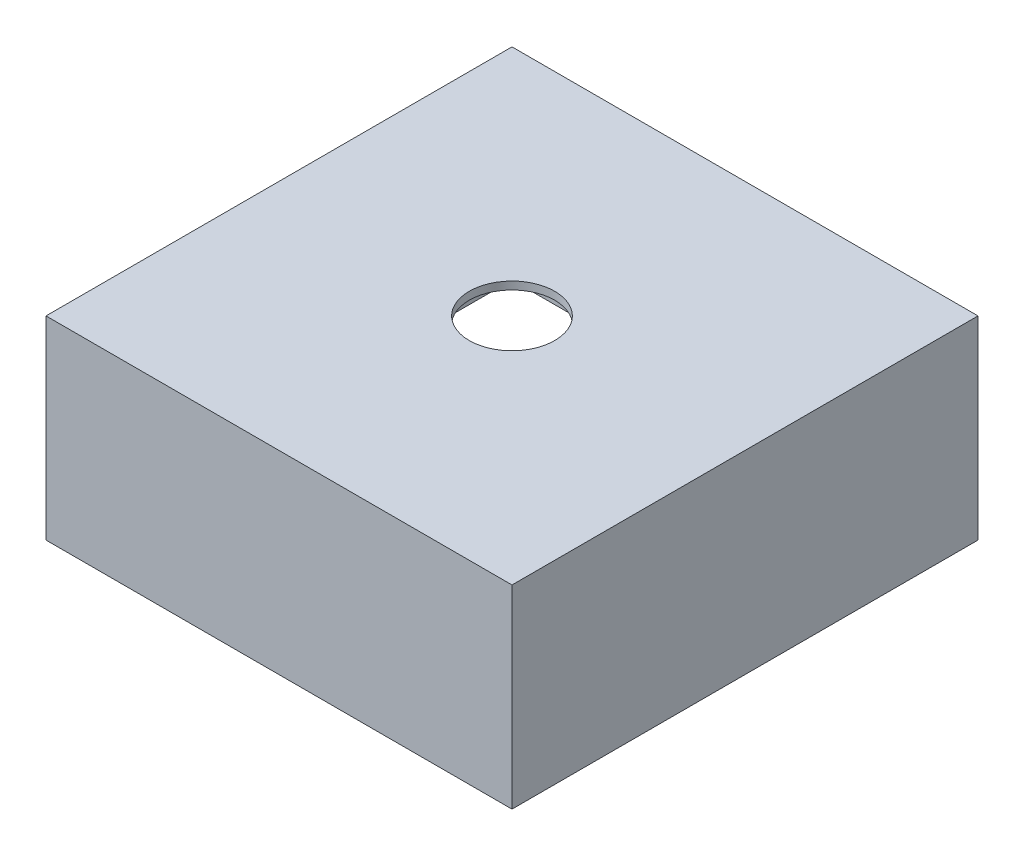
ISO-10303-21;
HEADER;
FILE_DESCRIPTION(('STEP AP214'),'2;1');
FILE_NAME('part.step','',(''),(''),'','','');
FILE_SCHEMA(('AUTOMOTIVE_DESIGN { 1 0 10303 214 1 1 1 1 }'));
ENDSEC;
DATA;
#1=APPLICATION_CONTEXT('core data for automotive mechanical design processes');
#2=APPLICATION_PROTOCOL_DEFINITION('international standard','automotive_design',2000,#1);
#3=PRODUCT_CONTEXT('',#1,'mechanical');
#4=PRODUCT('Part','Part','',(#3));
#5=PRODUCT_RELATED_PRODUCT_CATEGORY('part','',(#4));
#6=PRODUCT_DEFINITION_FORMATION('','',#4);
#7=PRODUCT_DEFINITION_CONTEXT('part definition',#1,'design');
#8=PRODUCT_DEFINITION('design','',#6,#7);
#9=PRODUCT_DEFINITION_SHAPE('','',#8);
#10=(LENGTH_UNIT() NAMED_UNIT(*) SI_UNIT(.MILLI.,.METRE.));
#11=(NAMED_UNIT(*) PLANE_ANGLE_UNIT() SI_UNIT($,.RADIAN.));
#12=(NAMED_UNIT(*) SI_UNIT($,.STERADIAN.) SOLID_ANGLE_UNIT());
#13=UNCERTAINTY_MEASURE_WITH_UNIT(LENGTH_MEASURE(1.E-05),#10,'distance_accuracy_value','');
#14=(GEOMETRIC_REPRESENTATION_CONTEXT(3) GLOBAL_UNCERTAINTY_ASSIGNED_CONTEXT((#13)) GLOBAL_UNIT_ASSIGNED_CONTEXT((#10,
#11,#12)) REPRESENTATION_CONTEXT('',''));
#15=CARTESIAN_POINT('',(0.,0.,0.));
#16=DIRECTION('',(0.,0.,1.));
#17=DIRECTION('',(1.,0.,0.));
#18=AXIS2_PLACEMENT_3D('',#15,#16,#17);
#19=CARTESIAN_POINT('',(0.,0.,0.));
#20=DIRECTION('',(0.,-1.,0.));
#21=DIRECTION('',(0.,0.,-1.));
#22=AXIS2_PLACEMENT_3D('',#19,#20,#21);
#23=PLANE('',#22);
#24=DIRECTION('',(0.,0.,1.));
#25=VECTOR('',#24,1.);
#26=CARTESIAN_POINT('',(-76.2,0.,-76.2));
#27=LINE('',#26,#25);
#28=CARTESIAN_POINT('',(-76.2,0.,-76.2));
#29=VERTEX_POINT('',#28);
#30=CARTESIAN_POINT('',(-76.2,0.,76.2));
#31=VERTEX_POINT('',#30);
#32=EDGE_CURVE('E140',#29,#31,#27,.T.);
#33=ORIENTED_EDGE('',*,*,#32,.F.);
#34=DIRECTION('',(-1.,0.,0.));
#35=VECTOR('',#34,1.);
#36=CARTESIAN_POINT('',(76.2,0.,-76.2));
#37=LINE('',#36,#35);
#38=CARTESIAN_POINT('',(76.2,0.,-76.2));
#39=VERTEX_POINT('',#38);
#40=EDGE_CURVE('E85',#39,#29,#37,.T.);
#41=ORIENTED_EDGE('',*,*,#40,.F.);
#42=DIRECTION('',(0.,0.,-1.));
#43=VECTOR('',#42,1.);
#44=CARTESIAN_POINT('',(76.2,0.,-76.2));
#45=LINE('',#44,#43);
#46=CARTESIAN_POINT('',(76.2,0.,76.2));
#47=VERTEX_POINT('',#46);
#48=EDGE_CURVE('E186',#47,#39,#45,.T.);
#49=ORIENTED_EDGE('',*,*,#48,.F.);
#50=DIRECTION('',(1.,0.,0.));
#51=VECTOR('',#50,1.);
#52=CARTESIAN_POINT('',(76.2,0.,76.2));
#53=LINE('',#52,#51);
#54=EDGE_CURVE('E146',#31,#47,#53,.T.);
#55=ORIENTED_EDGE('',*,*,#54,.F.);
#56=EDGE_LOOP('',(#33,#41,#49,#55));
#57=FACE_BOUND('',#56,.T.);
#58=DIRECTION('',(-1.,0.,0.));
#59=VECTOR('',#58,1.);
#60=CARTESIAN_POINT('',(0.,0.,-73.66));
#61=LINE('',#60,#59);
#62=CARTESIAN_POINT('',(73.66,0.,-73.66));
#63=VERTEX_POINT('',#62);
#64=CARTESIAN_POINT('',(-73.66,0.,-73.66));
#65=VERTEX_POINT('',#64);
#66=EDGE_CURVE('E134',#63,#65,#61,.T.);
#67=ORIENTED_EDGE('',*,*,#66,.T.);
#68=DIRECTION('',(0.,0.,1.));
#69=VECTOR('',#68,1.);
#70=CARTESIAN_POINT('',(-73.66,0.,0.));
#71=LINE('',#70,#69);
#72=CARTESIAN_POINT('',(-73.66,0.,73.66));
#73=VERTEX_POINT('',#72);
#74=EDGE_CURVE('E163',#65,#73,#71,.T.);
#75=ORIENTED_EDGE('',*,*,#74,.T.);
#76=DIRECTION('',(1.,0.,0.));
#77=VECTOR('',#76,1.);
#78=CARTESIAN_POINT('',(0.,0.,73.66));
#79=LINE('',#78,#77);
#80=CARTESIAN_POINT('',(73.66,0.,73.66));
#81=VERTEX_POINT('',#80);
#82=EDGE_CURVE('E138',#73,#81,#79,.T.);
#83=ORIENTED_EDGE('',*,*,#82,.T.);
#84=DIRECTION('',(0.,0.,-1.));
#85=VECTOR('',#84,1.);
#86=CARTESIAN_POINT('',(73.66,0.,0.));
#87=LINE('',#86,#85);
#88=EDGE_CURVE('E55',#81,#63,#87,.T.);
#89=ORIENTED_EDGE('',*,*,#88,.T.);
#90=EDGE_LOOP('',(#67,#75,#83,#89));
#91=FACE_BOUND('',#90,.T.);
#92=ADVANCED_FACE('F39',(#57,#91),#23,.T.);
#93=CARTESIAN_POINT('',(-76.2,63.5,-76.2));
#94=DIRECTION('',(1.,0.,0.));
#95=DIRECTION('',(0.,0.,-1.));
#96=AXIS2_PLACEMENT_3D('',#93,#94,#95);
#97=PLANE('',#96);
#98=ORIENTED_EDGE('',*,*,#32,.T.);
#99=DIRECTION('',(0.,-1.,0.));
#100=VECTOR('',#99,1.);
#101=CARTESIAN_POINT('',(-76.2,63.5,76.2));
#102=LINE('',#101,#100);
#103=CARTESIAN_POINT('',(-76.2,63.5,76.2));
#104=VERTEX_POINT('',#103);
#105=EDGE_CURVE('E11',#104,#31,#102,.T.);
#106=ORIENTED_EDGE('',*,*,#105,.F.);
#107=DIRECTION('',(0.,0.,1.));
#108=VECTOR('',#107,1.);
#109=CARTESIAN_POINT('',(-76.2,63.5,-76.2));
#110=LINE('',#109,#108);
#111=CARTESIAN_POINT('',(-76.2,63.5,-76.2));
#112=VERTEX_POINT('',#111);
#113=EDGE_CURVE('E173',#112,#104,#110,.T.);
#114=ORIENTED_EDGE('',*,*,#113,.F.);
#115=DIRECTION('',(0.,-1.,0.));
#116=VECTOR('',#115,1.);
#117=CARTESIAN_POINT('',(-76.2,63.5,-76.2));
#118=LINE('',#117,#116);
#119=EDGE_CURVE('E182',#112,#29,#118,.T.);
#120=ORIENTED_EDGE('',*,*,#119,.T.);
#121=EDGE_LOOP('',(#98,#106,#114,#120));
#122=FACE_BOUND('',#121,.T.);
#123=ADVANCED_FACE('F41',(#122),#97,.F.);
#124=CARTESIAN_POINT('',(76.2,63.5,76.2));
#125=DIRECTION('',(0.,0.,-1.));
#126=DIRECTION('',(-1.,0.,0.));
#127=AXIS2_PLACEMENT_3D('',#124,#125,#126);
#128=PLANE('',#127);
#129=ORIENTED_EDGE('',*,*,#54,.T.);
#130=DIRECTION('',(0.,-1.,0.));
#131=VECTOR('',#130,1.);
#132=CARTESIAN_POINT('',(76.2,63.5,76.2));
#133=LINE('',#132,#131);
#134=CARTESIAN_POINT('',(76.2,63.5,76.2));
#135=VERTEX_POINT('',#134);
#136=EDGE_CURVE('E48',#135,#47,#133,.T.);
#137=ORIENTED_EDGE('',*,*,#136,.F.);
#138=DIRECTION('',(1.,0.,0.));
#139=VECTOR('',#138,1.);
#140=CARTESIAN_POINT('',(76.2,63.5,76.2));
#141=LINE('',#140,#139);
#142=EDGE_CURVE('E92',#104,#135,#141,.T.);
#143=ORIENTED_EDGE('',*,*,#142,.F.);
#144=ORIENTED_EDGE('',*,*,#105,.T.);
#145=EDGE_LOOP('',(#129,#137,#143,#144));
#146=FACE_BOUND('',#145,.T.);
#147=ADVANCED_FACE('F218',(#146),#128,.F.);
#148=CARTESIAN_POINT('',(76.2,63.5,-76.2));
#149=DIRECTION('',(-1.,0.,0.));
#150=DIRECTION('',(0.,0.,1.));
#151=AXIS2_PLACEMENT_3D('',#148,#149,#150);
#152=PLANE('',#151);
#153=ORIENTED_EDGE('',*,*,#48,.T.);
#154=DIRECTION('',(0.,-1.,0.));
#155=VECTOR('',#154,1.);
#156=CARTESIAN_POINT('',(76.2,63.5,-76.2));
#157=LINE('',#156,#155);
#158=CARTESIAN_POINT('',(76.2,63.5,-76.2));
#159=VERTEX_POINT('',#158);
#160=EDGE_CURVE('E193',#159,#39,#157,.T.);
#161=ORIENTED_EDGE('',*,*,#160,.F.);
#162=DIRECTION('',(0.,0.,-1.));
#163=VECTOR('',#162,1.);
#164=CARTESIAN_POINT('',(76.2,63.5,-76.2));
#165=LINE('',#164,#163);
#166=EDGE_CURVE('E178',#135,#159,#165,.T.);
#167=ORIENTED_EDGE('',*,*,#166,.F.);
#168=ORIENTED_EDGE('',*,*,#136,.T.);
#169=EDGE_LOOP('',(#153,#161,#167,#168));
#170=FACE_BOUND('',#169,.T.);
#171=ADVANCED_FACE('F200',(#170),#152,.F.);
#172=CARTESIAN_POINT('',(76.2,63.5,-76.2));
#173=DIRECTION('',(0.,0.,1.));
#174=DIRECTION('',(1.,0.,0.));
#175=AXIS2_PLACEMENT_3D('',#172,#173,#174);
#176=PLANE('',#175);
#177=ORIENTED_EDGE('',*,*,#40,.T.);
#178=ORIENTED_EDGE('',*,*,#119,.F.);
#179=DIRECTION('',(-1.,0.,0.));
#180=VECTOR('',#179,1.);
#181=CARTESIAN_POINT('',(76.2,63.5,-76.2));
#182=LINE('',#181,#180);
#183=EDGE_CURVE('E64',#159,#112,#182,.T.);
#184=ORIENTED_EDGE('',*,*,#183,.F.);
#185=ORIENTED_EDGE('',*,*,#160,.T.);
#186=EDGE_LOOP('',(#177,#178,#184,#185));
#187=FACE_BOUND('',#186,.T.);
#188=ADVANCED_FACE('F208',(#187),#176,.F.);
#189=CARTESIAN_POINT('',(0.,63.5,0.));
#190=DIRECTION('',(0.,-1.,0.));
#191=DIRECTION('',(0.,0.,-1.));
#192=AXIS2_PLACEMENT_3D('',#189,#190,#191);
#193=PLANE('',#192);
#194=CARTESIAN_POINT('',(0.,63.5,0.));
#195=DIRECTION('',(0.,1.,0.));
#196=DIRECTION('',(0.,0.,1.));
#197=AXIS2_PLACEMENT_3D('',#194,#195,#196);
#198=CIRCLE('',#197,13.97);
#199=CARTESIAN_POINT('',(0.,63.5,13.97));
#200=VERTEX_POINT('',#199);
#201=EDGE_CURVE('E248',#200,#200,#198,.T.);
#202=ORIENTED_EDGE('',*,*,#201,.F.);
#203=EDGE_LOOP('',(#202));
#204=FACE_BOUND('',#203,.T.);
#205=ORIENTED_EDGE('',*,*,#113,.T.);
#206=ORIENTED_EDGE('',*,*,#142,.T.);
#207=ORIENTED_EDGE('',*,*,#166,.T.);
#208=ORIENTED_EDGE('',*,*,#183,.T.);
#209=EDGE_LOOP('',(#205,#206,#207,#208));
#210=FACE_BOUND('',#209,.T.);
#211=ADVANCED_FACE('F210',(#204,#210),#193,.F.);
#212=CARTESIAN_POINT('',(-73.66,63.5,-76.2));
#213=DIRECTION('',(1.,0.,0.));
#214=DIRECTION('',(0.,0.,-1.));
#215=AXIS2_PLACEMENT_3D('',#212,#213,#214);
#216=PLANE('',#215);
#217=ORIENTED_EDGE('',*,*,#74,.F.);
#218=DIRECTION('',(0.,-1.,0.));
#219=VECTOR('',#218,1.);
#220=CARTESIAN_POINT('',(-73.66,63.5,-73.66));
#221=LINE('',#220,#219);
#222=CARTESIAN_POINT('',(-73.66,60.96,-73.66));
#223=VERTEX_POINT('',#222);
#224=EDGE_CURVE('E132',#223,#65,#221,.T.);
#225=ORIENTED_EDGE('',*,*,#224,.F.);
#226=DIRECTION('',(0.,0.,1.));
#227=VECTOR('',#226,1.);
#228=CARTESIAN_POINT('',(-73.66,60.96,0.));
#229=LINE('',#228,#227);
#230=CARTESIAN_POINT('',(-73.66,60.96,73.66));
#231=VERTEX_POINT('',#230);
#232=EDGE_CURVE('E119',#223,#231,#229,.T.);
#233=ORIENTED_EDGE('',*,*,#232,.T.);
#234=DIRECTION('',(0.,-1.,0.));
#235=VECTOR('',#234,1.);
#236=CARTESIAN_POINT('',(-73.66,63.5,73.66));
#237=LINE('',#236,#235);
#238=EDGE_CURVE('E130',#231,#73,#237,.T.);
#239=ORIENTED_EDGE('',*,*,#238,.T.);
#240=EDGE_LOOP('',(#217,#225,#233,#239));
#241=FACE_BOUND('',#240,.T.);
#242=ADVANCED_FACE('F129',(#241),#216,.T.);
#243=CARTESIAN_POINT('',(76.2,63.5,73.66));
#244=DIRECTION('',(0.,0.,-1.));
#245=DIRECTION('',(-1.,0.,0.));
#246=AXIS2_PLACEMENT_3D('',#243,#244,#245);
#247=PLANE('',#246);
#248=ORIENTED_EDGE('',*,*,#82,.F.);
#249=ORIENTED_EDGE('',*,*,#238,.F.);
#250=DIRECTION('',(1.,0.,0.));
#251=VECTOR('',#250,1.);
#252=CARTESIAN_POINT('',(0.,60.96,73.66));
#253=LINE('',#252,#251);
#254=CARTESIAN_POINT('',(73.66,60.96,73.66));
#255=VERTEX_POINT('',#254);
#256=EDGE_CURVE('E115',#231,#255,#253,.T.);
#257=ORIENTED_EDGE('',*,*,#256,.T.);
#258=DIRECTION('',(0.,-1.,0.));
#259=VECTOR('',#258,1.);
#260=CARTESIAN_POINT('',(73.66,63.5,73.66));
#261=LINE('',#260,#259);
#262=EDGE_CURVE('E141',#255,#81,#261,.T.);
#263=ORIENTED_EDGE('',*,*,#262,.T.);
#264=EDGE_LOOP('',(#248,#249,#257,#263));
#265=FACE_BOUND('',#264,.T.);
#266=ADVANCED_FACE('F136',(#265),#247,.T.);
#267=CARTESIAN_POINT('',(73.66,63.5,-76.2));
#268=DIRECTION('',(-1.,0.,0.));
#269=DIRECTION('',(0.,0.,1.));
#270=AXIS2_PLACEMENT_3D('',#267,#268,#269);
#271=PLANE('',#270);
#272=ORIENTED_EDGE('',*,*,#88,.F.);
#273=ORIENTED_EDGE('',*,*,#262,.F.);
#274=DIRECTION('',(0.,0.,-1.));
#275=VECTOR('',#274,1.);
#276=CARTESIAN_POINT('',(73.66,60.96,0.));
#277=LINE('',#276,#275);
#278=CARTESIAN_POINT('',(73.66,60.96,-73.66));
#279=VERTEX_POINT('',#278);
#280=EDGE_CURVE('E120',#255,#279,#277,.T.);
#281=ORIENTED_EDGE('',*,*,#280,.T.);
#282=DIRECTION('',(0.,-1.,0.));
#283=VECTOR('',#282,1.);
#284=CARTESIAN_POINT('',(73.66,63.5,-73.66));
#285=LINE('',#284,#283);
#286=EDGE_CURVE('E148',#279,#63,#285,.T.);
#287=ORIENTED_EDGE('',*,*,#286,.T.);
#288=EDGE_LOOP('',(#272,#273,#281,#287));
#289=FACE_BOUND('',#288,.T.);
#290=ADVANCED_FACE('F233',(#289),#271,.T.);
#291=CARTESIAN_POINT('',(76.2,63.5,-73.66));
#292=DIRECTION('',(0.,0.,1.));
#293=DIRECTION('',(1.,0.,0.));
#294=AXIS2_PLACEMENT_3D('',#291,#292,#293);
#295=PLANE('',#294);
#296=ORIENTED_EDGE('',*,*,#66,.F.);
#297=ORIENTED_EDGE('',*,*,#286,.F.);
#298=DIRECTION('',(-1.,0.,0.));
#299=VECTOR('',#298,1.);
#300=CARTESIAN_POINT('',(0.,60.96,-73.66));
#301=LINE('',#300,#299);
#302=EDGE_CURVE('E155',#279,#223,#301,.T.);
#303=ORIENTED_EDGE('',*,*,#302,.T.);
#304=ORIENTED_EDGE('',*,*,#224,.T.);
#305=EDGE_LOOP('',(#296,#297,#303,#304));
#306=FACE_BOUND('',#305,.T.);
#307=ADVANCED_FACE('F229',(#306),#295,.T.);
#308=CARTESIAN_POINT('',(0.,60.96,0.));
#309=DIRECTION('',(0.,-1.,0.));
#310=DIRECTION('',(0.,0.,-1.));
#311=AXIS2_PLACEMENT_3D('',#308,#309,#310);
#312=PLANE('',#311);
#313=CARTESIAN_POINT('',(0.,60.96,0.));
#314=DIRECTION('',(0.,-1.,0.));
#315=DIRECTION('',(0.,0.,-1.));
#316=AXIS2_PLACEMENT_3D('',#313,#314,#315);
#317=CIRCLE('',#316,13.97);
#318=CARTESIAN_POINT('',(0.,60.96,-13.97));
#319=VERTEX_POINT('',#318);
#320=EDGE_CURVE('E151',#319,#319,#317,.F.);
#321=ORIENTED_EDGE('',*,*,#320,.T.);
#322=EDGE_LOOP('',(#321));
#323=FACE_BOUND('',#322,.T.);
#324=ORIENTED_EDGE('',*,*,#232,.F.);
#325=ORIENTED_EDGE('',*,*,#302,.F.);
#326=ORIENTED_EDGE('',*,*,#280,.F.);
#327=ORIENTED_EDGE('',*,*,#256,.F.);
#328=EDGE_LOOP('',(#324,#325,#326,#327));
#329=FACE_BOUND('',#328,.T.);
#330=ADVANCED_FACE('F117',(#323,#329),#312,.T.);
#331=CARTESIAN_POINT('',(0.,21.4468730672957,0.));
#332=DIRECTION('',(0.,1.,0.));
#333=DIRECTION('',(0.,0.,1.));
#334=AXIS2_PLACEMENT_3D('',#331,#332,#333);
#335=CYLINDRICAL_SURFACE('',#334,13.97);
#336=ORIENTED_EDGE('',*,*,#201,.T.);
#337=EDGE_LOOP('',(#336));
#338=FACE_BOUND('',#337,.T.);
#339=ORIENTED_EDGE('',*,*,#320,.F.);
#340=EDGE_LOOP('',(#339));
#341=FACE_BOUND('',#340,.T.);
#342=ADVANCED_FACE('F228',(#338,#341),#335,.F.);
#343=CLOSED_SHELL('',(#92,#123,#147,#171,#188,#211,#242,#266,#290,#307,#330,#342));
#344=MANIFOLD_SOLID_BREP('B2',#343);
#345=ADVANCED_BREP_SHAPE_REPRESENTATION('',(#18,#344),#14);
#346=SHAPE_DEFINITION_REPRESENTATION(#9,#345);
ENDSEC;
END-ISO-10303-21;
